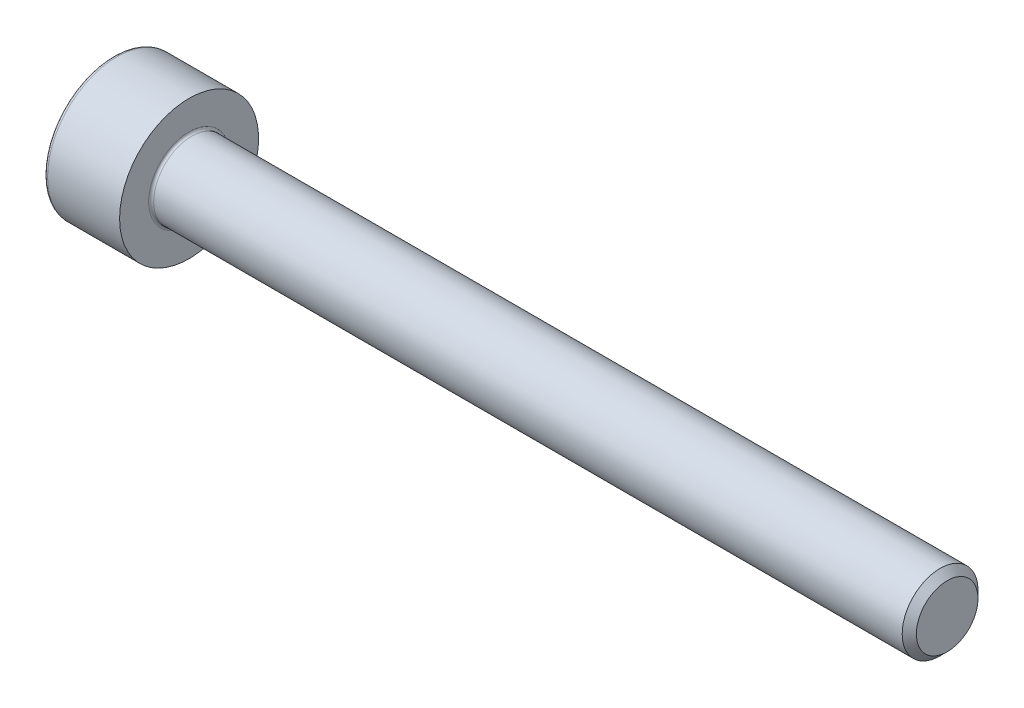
from build123d import *

# Parameters (mm, degrees)
FILLET1_R   = 0.1
FILLET2_R   = 0.15
HEX_2_DEPTH = 1.3


with BuildPart() as part:
    # BodySke → Base-Revolve (revolve)
    with BuildSketch(Plane.XY, mode=Mode.PRIVATE) as base_revolve_sk:
        Polygon((0, 0), (0, 2.75), (3, 2.75), (3, 1.5), (32.7195, 1.5), (33, 1.2195), (33, 0), align=None)
    revolve(base_revolve_sk.sketch.rotate(Axis((-31.75, 0, 0), (1, 0, 0)), 90), axis=Axis((-31.75, 0, 0), (1, 0, 0)))

    # Fillet1
    fillet1_edges = [part.edges().sort_by_distance(p)[0] for p in [
        (3, 0, -1.5),
    ]]
    fillet(fillet1_edges, radius=FILLET1_R)

    # Fillet2
    fillet2_edges = [part.edges().sort_by_distance(p)[0] for p in [
        (0, 0, -2.75),
    ]]
    fillet(fillet2_edges, radius=FILLET2_R)

    # Sketch2 → Hex-PreBroach (revolve, cut)
    with BuildSketch(Plane.XY, mode=Mode.PRIVATE) as hex_prebroach_sk:
        Polygon((0, 1.28), (1.3, 1.28), (2.039008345, 0), (0, 0), align=None)
    revolve(hex_prebroach_sk.sketch.rotate(Axis((0, 0, 0), (1, 0, 0)), 90), axis=Axis((0, 0, 0), (1, 0, 0)), mode=Mode.SUBTRACT)

    # Sketch3 → Hex 2 (cut)
    with BuildSketch(Plane(origin=(0, 0, 0), x_dir=(0, 0.500000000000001, 0.866025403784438), z_dir=(-1, 0, 0))):
        Polygon((0.739008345, 1.28), (-0.739008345, 1.28), (-1.478016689, 0), (-0.739008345, -1.28), (0.739008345, -1.28), (1.478016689, 0), align=None)
    extrude(amount=-HEX_2_DEPTH, mode=Mode.SUBTRACT)


solid = part.part
